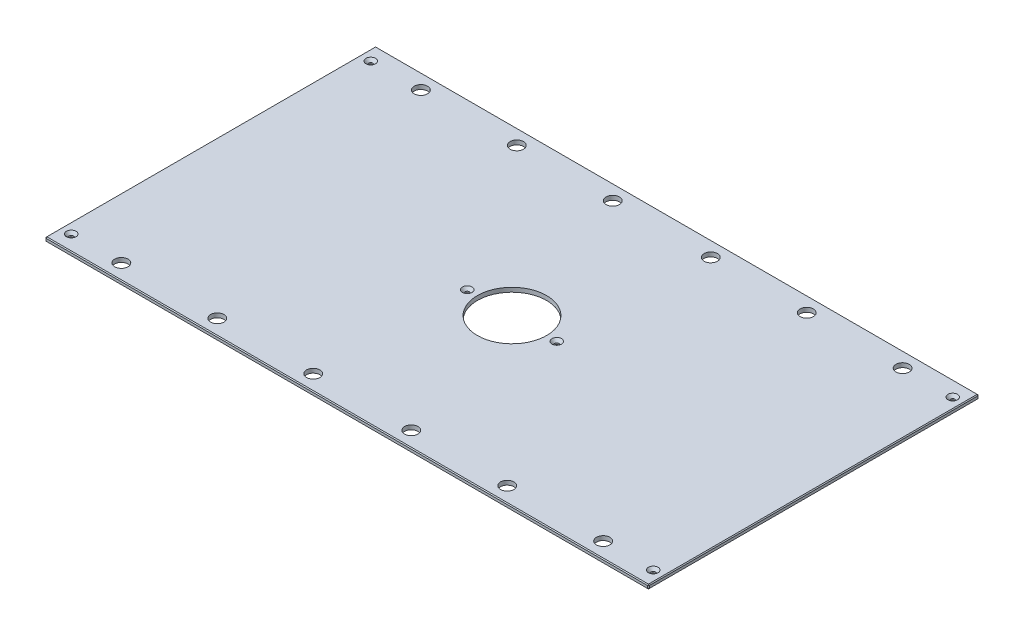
from build123d import *

# Parameters (mm, degrees)
SKETCH1_W                                     = 898.525
SKETCH1_H                                     = 492.125
BOSS_EXTRUDE1_DEPTH                           = 6.35
SKETCH13_R                                    = 51.562
CUT_EXTRUDE6_DEPTH                            = 513.273237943
F_25_32_0_78125_DIAMETER_HOLE1_D              = 19.84375
CHAMFER2_SIZE                                 = 1.27
CSK_FOR_1_4_FLAT_HEAD_MACHINE_SCREW1_AT_COUNT = 2
CSK_FOR_1_4_FLAT_HEAD_MACHINE_SCREW1_AT_PITCH = 446.08496
CSK_FOR_1_4_FLAT_HEAD_MACHINE_SCREW1_2_COUNT  = 2
CSK_FOR_1_4_FLAT_HEAD_MACHINE_SCREW1_2_PITCH  = 974.828545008
CSK_FOR_1_4_FLAT_HEAD_MACHINE_SCREW1_3_COUNT  = 2
CSK_FOR_1_4_FLAT_HEAD_MACHINE_SCREW1_3_PITCH  = 547.549497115
CSK_FOR_1_4_FLAT_HEAD_MACHINE_SCREW1_4_COUNT  = 2
CSK_FOR_1_4_FLAT_HEAD_MACHINE_SCREW1_4_PITCH  = 429.215570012
CSK_FOR_1_4_FLAT_HEAD_MACHINE_SCREW1_5_COUNT  = 2
CSK_FOR_1_4_FLAT_HEAD_MACHINE_SCREW1_5_PITCH  = 866.775
CSK_FOR_1_4_FLAT_HEAD_MACHINE_SCREW1_6_COUNT  = 2
CSK_FOR_1_4_FLAT_HEAD_MACHINE_SCREW1_6_PITCH  = 792.1625
CSK_FOR_1_4_FLAT_HEAD_MACHINE_SCREW1_7_COUNT  = 2
CSK_FOR_1_4_FLAT_HEAD_MACHINE_SCREW1_7_PITCH  = 909.127723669


with BuildPart() as part:
    # Sketch1 → Boss-Extrude1 (new body)
    with BuildSketch(Plane(origin=(0, 0, 0), x_dir=(1, 0, 0), z_dir=(0, 1, 0))):
        Rectangle(SKETCH1_W, SKETCH1_H)
    extrude(amount=BOSS_EXTRUDE1_DEPTH)

    # Sketch13 → Cut-Extrude6 (cut, through all)
    with BuildSketch(Plane(origin=(0, 6.35, 0), x_dir=(1, 0, 0), z_dir=(0, 1, 0))):
        with Locations(Location((0, 0, 0), (0, 0, 270))):
            Circle(SKETCH13_R)
    extrude(amount=-CUT_EXTRUDE6_DEPTH, mode=Mode.SUBTRACT)

    # 25_32 _0.78125_ Diameter Hole1 (through all)
    with Locations(Plane(origin=(0, 6.35, 0), x_dir=(1, 0, 0), z_dir=(0, 1, 0))):
        with Locations((358.775, 223.04248), (-358.775, 223.04248), (358.775, -223.04248), (-358.775, -223.04248), (-215.9, 223.04248), (215.9, 223.04248), (215.9, -223.04248), (-215.9, -223.04248), (73.025, 223.04248), (-73.025, 223.04248), (-73.025, -223.04248), (73.025, -223.04248)):
            Hole(F_25_32_0_78125_DIAMETER_HOLE1_D / 2)

    # Chamfer2
    chamfer2_edges = [part.edges().sort_by_distance(p)[0] for p in [
        (449.2625, 6.35, 0),
        (0, 6.35, -246.0625),
        (-449.2625, 6.35, 0),
        (0, 0, -246.0625),
        (449.2625, 0, 0),
        (0, 0, 246.0625),
        (-449.2625, 0, 0),
        (0, 6.35, 246.0625),
        (-449.2625, 3.175, -246.0625),
        (449.2625, 3.175, -246.0625),
        (449.2625, 3.175, 246.0625),
        (-449.2625, 3.175, 246.0625),
    ]]
    chamfer(chamfer2_edges, length=CHAMFER2_SIZE)

    # Sketch24 → CSK for 1_4 Flat Head Machine Screw1 (revolve, cut)
    with BuildSketch(Plane(origin=(433.3875, 6.35, -223.04248), x_dir=(0, 0, 1), z_dir=(1, 0, 0))):
        Polygon((0, 0), (0, 6.35), (3.3782, 6.35), (3.3782, 4.324464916), (7.1374, 0), align=None)
    csk_for_1_4_flat_head_machine_screw1 = revolve(axis=Axis((433.3875, 12.7, -223.04248), (0, -1, 0)), mode=Mode.SUBTRACT)

    # CSK for 1_4 Flat Head Machine Screw1 at: CSK for 1_4 Flat Head Machine Screw1 ×2
    with Locations(*[(0, 0, i * CSK_FOR_1_4_FLAT_HEAD_MACHINE_SCREW1_AT_PITCH) for i in range(1, CSK_FOR_1_4_FLAT_HEAD_MACHINE_SCREW1_AT_COUNT)]):
        add(csk_for_1_4_flat_head_machine_screw1, mode=Mode.SUBTRACT)

    # CSK for 1_4 Flat Head Machine Screw1 2: CSK for 1_4 Flat Head Machine Screw1 ×2
    with Locations(*[Vector(-0.8891563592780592, 0, 0.45760350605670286) * (i * CSK_FOR_1_4_FLAT_HEAD_MACHINE_SCREW1_2_PITCH) for i in range(1, CSK_FOR_1_4_FLAT_HEAD_MACHINE_SCREW1_2_COUNT)]):
        add(csk_for_1_4_flat_head_machine_screw1, mode=Mode.SUBTRACT)

    # CSK for 1_4 Flat Head Machine Screw1 3: CSK for 1_4 Flat Head Machine Screw1 ×2
    with Locations(*[Vector(-0.9132735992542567, 0, 0.4073466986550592) * (i * CSK_FOR_1_4_FLAT_HEAD_MACHINE_SCREW1_3_PITCH) for i in range(1, CSK_FOR_1_4_FLAT_HEAD_MACHINE_SCREW1_3_COUNT)]):
        add(csk_for_1_4_flat_head_machine_screw1, mode=Mode.SUBTRACT)

    # CSK for 1_4 Flat Head Machine Screw1 4: CSK for 1_4 Flat Head Machine Screw1 ×2
    with Locations(*[Vector(-0.8543783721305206, 0, 0.5196514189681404) * (i * CSK_FOR_1_4_FLAT_HEAD_MACHINE_SCREW1_4_PITCH) for i in range(1, CSK_FOR_1_4_FLAT_HEAD_MACHINE_SCREW1_4_COUNT)]):
        add(csk_for_1_4_flat_head_machine_screw1, mode=Mode.SUBTRACT)

    # CSK for 1_4 Flat Head Machine Screw1 5: CSK for 1_4 Flat Head Machine Screw1 ×2
    with Locations(*[(-i * CSK_FOR_1_4_FLAT_HEAD_MACHINE_SCREW1_5_PITCH, 0, 0) for i in range(1, CSK_FOR_1_4_FLAT_HEAD_MACHINE_SCREW1_5_COUNT)]):
        add(csk_for_1_4_flat_head_machine_screw1, mode=Mode.SUBTRACT)

    # CSK for 1_4 Flat Head Machine Screw1 6: CSK for 1_4 Flat Head Machine Screw1 ×2
    with Locations(*[(-i * CSK_FOR_1_4_FLAT_HEAD_MACHINE_SCREW1_6_PITCH, 0, 0) for i in range(1, CSK_FOR_1_4_FLAT_HEAD_MACHINE_SCREW1_6_COUNT)]):
        add(csk_for_1_4_flat_head_machine_screw1, mode=Mode.SUBTRACT)

    # CSK for 1_4 Flat Head Machine Screw1 7: CSK for 1_4 Flat Head Machine Screw1 ×2
    with Locations(*[Vector(-0.8713434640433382, 0, 0.49067358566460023) * (i * CSK_FOR_1_4_FLAT_HEAD_MACHINE_SCREW1_7_PITCH) for i in range(1, CSK_FOR_1_4_FLAT_HEAD_MACHINE_SCREW1_7_COUNT)]):
        add(csk_for_1_4_flat_head_machine_screw1, mode=Mode.SUBTRACT)


solid = part.part
